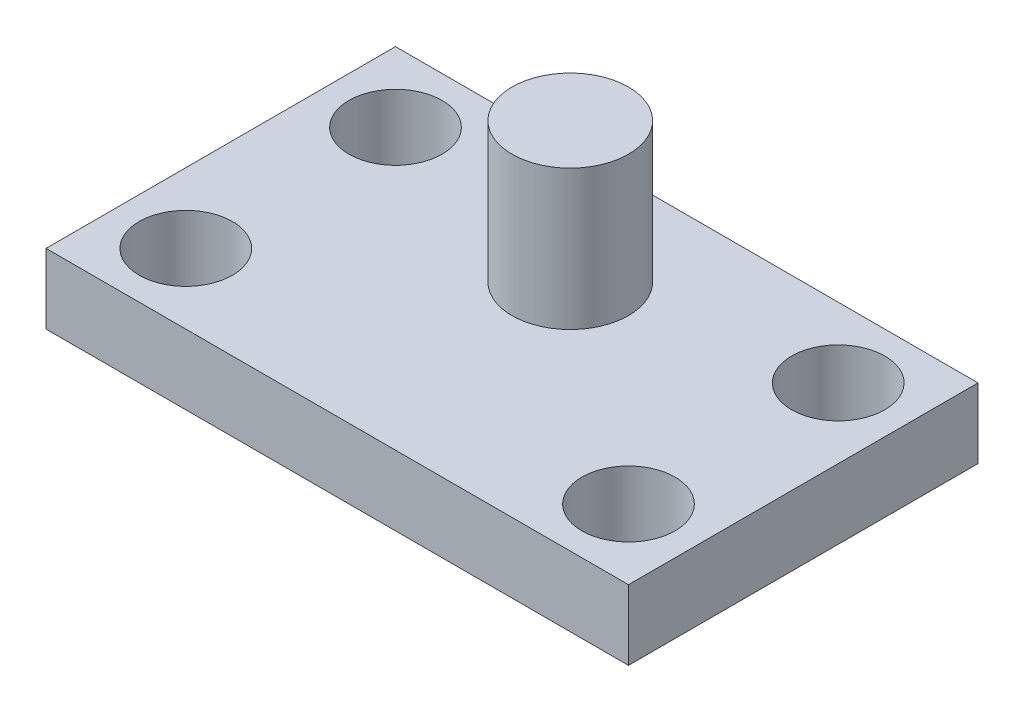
ISO-10303-21;
HEADER;
FILE_DESCRIPTION(('STEP AP214'),'2;1');
FILE_NAME('part.step','',(''),(''),'','','');
FILE_SCHEMA(('AUTOMOTIVE_DESIGN { 1 0 10303 214 1 1 1 1 }'));
ENDSEC;
DATA;
#1=APPLICATION_CONTEXT('core data for automotive mechanical design processes');
#2=APPLICATION_PROTOCOL_DEFINITION('international standard','automotive_design',2000,#1);
#3=PRODUCT_CONTEXT('',#1,'mechanical');
#4=PRODUCT('Part','Part','',(#3));
#5=PRODUCT_RELATED_PRODUCT_CATEGORY('part','',(#4));
#6=PRODUCT_DEFINITION_FORMATION('','',#4);
#7=PRODUCT_DEFINITION_CONTEXT('part definition',#1,'design');
#8=PRODUCT_DEFINITION('design','',#6,#7);
#9=PRODUCT_DEFINITION_SHAPE('','',#8);
#10=(LENGTH_UNIT() NAMED_UNIT(*) SI_UNIT(.MILLI.,.METRE.));
#11=(NAMED_UNIT(*) PLANE_ANGLE_UNIT() SI_UNIT($,.RADIAN.));
#12=(NAMED_UNIT(*) SI_UNIT($,.STERADIAN.) SOLID_ANGLE_UNIT());
#13=UNCERTAINTY_MEASURE_WITH_UNIT(LENGTH_MEASURE(1.E-05),#10,'distance_accuracy_value','');
#14=(GEOMETRIC_REPRESENTATION_CONTEXT(3) GLOBAL_UNCERTAINTY_ASSIGNED_CONTEXT((#13)) GLOBAL_UNIT_ASSIGNED_CONTEXT((#10,
#11,#12)) REPRESENTATION_CONTEXT('',''));
#15=CARTESIAN_POINT('',(0.,0.,0.));
#16=DIRECTION('',(0.,0.,1.));
#17=DIRECTION('',(1.,0.,0.));
#18=AXIS2_PLACEMENT_3D('',#15,#16,#17);
#19=CARTESIAN_POINT('',(0.,30.,0.));
#20=DIRECTION('',(0.,-1.,0.));
#21=DIRECTION('',(0.,0.,-1.));
#22=AXIS2_PLACEMENT_3D('',#19,#20,#21);
#23=PLANE('',#22);
#24=CARTESIAN_POINT('',(125.,30.,-100.));
#25=DIRECTION('',(0.,-1.,0.));
#26=DIRECTION('',(0.,0.,-1.));
#27=AXIS2_PLACEMENT_3D('',#24,#25,#26);
#28=CIRCLE('',#27,25.);
#29=CARTESIAN_POINT('',(125.,30.,-125.));
#30=VERTEX_POINT('',#29);
#31=EDGE_CURVE('E139',#30,#30,#28,.T.);
#32=ORIENTED_EDGE('',*,*,#31,.T.);
#33=EDGE_LOOP('',(#32));
#34=FACE_BOUND('',#33,.T.);
#35=DIRECTION('',(0.,0.,1.));
#36=VECTOR('',#35,1.);
#37=CARTESIAN_POINT('',(0.,30.,0.));
#38=LINE('',#37,#36);
#39=CARTESIAN_POINT('',(0.,30.,-150.));
#40=VERTEX_POINT('',#39);
#41=CARTESIAN_POINT('',(0.,30.,0.));
#42=VERTEX_POINT('',#41);
#43=EDGE_CURVE('E91',#40,#42,#38,.T.);
#44=ORIENTED_EDGE('',*,*,#43,.T.);
#45=DIRECTION('',(1.,0.,0.));
#46=VECTOR('',#45,1.);
#47=CARTESIAN_POINT('',(0.,30.,0.));
#48=LINE('',#47,#46);
#49=CARTESIAN_POINT('',(250.,30.,0.));
#50=VERTEX_POINT('',#49);
#51=EDGE_CURVE('E86',#42,#50,#48,.T.);
#52=ORIENTED_EDGE('',*,*,#51,.T.);
#53=DIRECTION('',(0.,0.,-1.));
#54=VECTOR('',#53,1.);
#55=CARTESIAN_POINT('',(250.,30.,0.));
#56=LINE('',#55,#54);
#57=CARTESIAN_POINT('',(250.,30.,-150.));
#58=VERTEX_POINT('',#57);
#59=EDGE_CURVE('E89',#50,#58,#56,.T.);
#60=ORIENTED_EDGE('',*,*,#59,.T.);
#61=DIRECTION('',(-1.,0.,0.));
#62=VECTOR('',#61,1.);
#63=CARTESIAN_POINT('',(0.,30.,-150.));
#64=LINE('',#63,#62);
#65=EDGE_CURVE('E56',#58,#40,#64,.T.);
#66=ORIENTED_EDGE('',*,*,#65,.T.);
#67=EDGE_LOOP('',(#44,#52,#60,#66));
#68=FACE_BOUND('',#67,.T.);
#69=CARTESIAN_POINT('',(30.,30.,-120.));
#70=DIRECTION('',(0.,1.,0.));
#71=DIRECTION('',(0.,0.,1.));
#72=AXIS2_PLACEMENT_3D('',#69,#70,#71);
#73=CIRCLE('',#72,20.);
#74=CARTESIAN_POINT('',(30.,30.,-100.));
#75=VERTEX_POINT('',#74);
#76=EDGE_CURVE('E106',#75,#75,#73,.T.);
#77=ORIENTED_EDGE('',*,*,#76,.F.);
#78=EDGE_LOOP('',(#77));
#79=FACE_BOUND('',#78,.T.);
#80=CARTESIAN_POINT('',(30.,30.,-30.));
#81=DIRECTION('',(0.,1.,0.));
#82=DIRECTION('',(0.,0.,1.));
#83=AXIS2_PLACEMENT_3D('',#80,#81,#82);
#84=CIRCLE('',#83,20.);
#85=CARTESIAN_POINT('',(30.,30.,-9.99999999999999));
#86=VERTEX_POINT('',#85);
#87=EDGE_CURVE('E121',#86,#86,#84,.T.);
#88=ORIENTED_EDGE('',*,*,#87,.F.);
#89=EDGE_LOOP('',(#88));
#90=FACE_BOUND('',#89,.T.);
#91=CARTESIAN_POINT('',(220.,30.,-30.));
#92=DIRECTION('',(0.,1.,0.));
#93=DIRECTION('',(0.,0.,1.));
#94=AXIS2_PLACEMENT_3D('',#91,#92,#93);
#95=CIRCLE('',#94,20.);
#96=CARTESIAN_POINT('',(220.,30.,-10.));
#97=VERTEX_POINT('',#96);
#98=EDGE_CURVE('E127',#97,#97,#95,.T.);
#99=ORIENTED_EDGE('',*,*,#98,.F.);
#100=EDGE_LOOP('',(#99));
#101=FACE_BOUND('',#100,.T.);
#102=CARTESIAN_POINT('',(220.,30.,-120.));
#103=DIRECTION('',(0.,1.,0.));
#104=DIRECTION('',(0.,0.,1.));
#105=AXIS2_PLACEMENT_3D('',#102,#103,#104);
#106=CIRCLE('',#105,20.);
#107=CARTESIAN_POINT('',(220.,30.,-100.));
#108=VERTEX_POINT('',#107);
#109=EDGE_CURVE('E133',#108,#108,#106,.T.);
#110=ORIENTED_EDGE('',*,*,#109,.F.);
#111=EDGE_LOOP('',(#110));
#112=FACE_BOUND('',#111,.T.);
#113=ADVANCED_FACE('F39',(#34,#68,#79,#90,#101,#112),#23,.F.);
#114=CARTESIAN_POINT('',(0.,0.,0.));
#115=DIRECTION('',(0.,-1.,0.));
#116=DIRECTION('',(0.,0.,-1.));
#117=AXIS2_PLACEMENT_3D('',#114,#115,#116);
#118=PLANE('',#117);
#119=CARTESIAN_POINT('',(220.,0.,-30.));
#120=DIRECTION('',(0.,1.,0.));
#121=DIRECTION('',(0.,0.,1.));
#122=AXIS2_PLACEMENT_3D('',#119,#120,#121);
#123=CIRCLE('',#122,20.);
#124=CARTESIAN_POINT('',(220.,0.,-10.));
#125=VERTEX_POINT('',#124);
#126=EDGE_CURVE('E130',#125,#125,#123,.T.);
#127=ORIENTED_EDGE('',*,*,#126,.T.);
#128=EDGE_LOOP('',(#127));
#129=FACE_BOUND('',#128,.T.);
#130=CARTESIAN_POINT('',(30.,0.,-120.));
#131=DIRECTION('',(0.,1.,0.));
#132=DIRECTION('',(0.,0.,1.));
#133=AXIS2_PLACEMENT_3D('',#130,#131,#132);
#134=CIRCLE('',#133,20.);
#135=CARTESIAN_POINT('',(30.,0.,-100.));
#136=VERTEX_POINT('',#135);
#137=EDGE_CURVE('E118',#136,#136,#134,.T.);
#138=ORIENTED_EDGE('',*,*,#137,.T.);
#139=EDGE_LOOP('',(#138));
#140=FACE_BOUND('',#139,.T.);
#141=DIRECTION('',(0.,0.,1.));
#142=VECTOR('',#141,1.);
#143=CARTESIAN_POINT('',(0.,0.,0.));
#144=LINE('',#143,#142);
#145=CARTESIAN_POINT('',(0.,0.,-150.));
#146=VERTEX_POINT('',#145);
#147=CARTESIAN_POINT('',(0.,0.,0.));
#148=VERTEX_POINT('',#147);
#149=EDGE_CURVE('E103',#146,#148,#144,.T.);
#150=ORIENTED_EDGE('',*,*,#149,.F.);
#151=DIRECTION('',(-1.,0.,0.));
#152=VECTOR('',#151,1.);
#153=CARTESIAN_POINT('',(0.,0.,-150.));
#154=LINE('',#153,#152);
#155=CARTESIAN_POINT('',(250.,0.,-150.));
#156=VERTEX_POINT('',#155);
#157=EDGE_CURVE('E79',#156,#146,#154,.T.);
#158=ORIENTED_EDGE('',*,*,#157,.F.);
#159=DIRECTION('',(0.,0.,-1.));
#160=VECTOR('',#159,1.);
#161=CARTESIAN_POINT('',(250.,0.,0.));
#162=LINE('',#161,#160);
#163=CARTESIAN_POINT('',(250.,0.,0.));
#164=VERTEX_POINT('',#163);
#165=EDGE_CURVE('E73',#164,#156,#162,.T.);
#166=ORIENTED_EDGE('',*,*,#165,.F.);
#167=DIRECTION('',(1.,0.,0.));
#168=VECTOR('',#167,1.);
#169=CARTESIAN_POINT('',(0.,0.,0.));
#170=LINE('',#169,#168);
#171=EDGE_CURVE('E95',#148,#164,#170,.T.);
#172=ORIENTED_EDGE('',*,*,#171,.F.);
#173=EDGE_LOOP('',(#150,#158,#166,#172));
#174=FACE_BOUND('',#173,.T.);
#175=CARTESIAN_POINT('',(30.,0.,-30.));
#176=DIRECTION('',(0.,1.,0.));
#177=DIRECTION('',(0.,0.,1.));
#178=AXIS2_PLACEMENT_3D('',#175,#176,#177);
#179=CIRCLE('',#178,20.);
#180=CARTESIAN_POINT('',(30.,0.,-9.99999999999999));
#181=VERTEX_POINT('',#180);
#182=EDGE_CURVE('E124',#181,#181,#179,.T.);
#183=ORIENTED_EDGE('',*,*,#182,.T.);
#184=EDGE_LOOP('',(#183));
#185=FACE_BOUND('',#184,.T.);
#186=CARTESIAN_POINT('',(220.,0.,-120.));
#187=DIRECTION('',(0.,1.,0.));
#188=DIRECTION('',(0.,0.,1.));
#189=AXIS2_PLACEMENT_3D('',#186,#187,#188);
#190=CIRCLE('',#189,20.);
#191=CARTESIAN_POINT('',(220.,0.,-100.));
#192=VERTEX_POINT('',#191);
#193=EDGE_CURVE('E136',#192,#192,#190,.T.);
#194=ORIENTED_EDGE('',*,*,#193,.T.);
#195=EDGE_LOOP('',(#194));
#196=FACE_BOUND('',#195,.T.);
#197=ADVANCED_FACE('F114',(#129,#140,#174,#185,#196),#118,.T.);
#198=CARTESIAN_POINT('',(0.,30.,0.));
#199=DIRECTION('',(1.,0.,0.));
#200=DIRECTION('',(0.,0.,-1.));
#201=AXIS2_PLACEMENT_3D('',#198,#199,#200);
#202=PLANE('',#201);
#203=ORIENTED_EDGE('',*,*,#149,.T.);
#204=DIRECTION('',(0.,-1.,0.));
#205=VECTOR('',#204,1.);
#206=CARTESIAN_POINT('',(0.,30.,0.));
#207=LINE('',#206,#205);
#208=EDGE_CURVE('E11',#42,#148,#207,.T.);
#209=ORIENTED_EDGE('',*,*,#208,.F.);
#210=ORIENTED_EDGE('',*,*,#43,.F.);
#211=DIRECTION('',(0.,-1.,0.));
#212=VECTOR('',#211,1.);
#213=CARTESIAN_POINT('',(0.,30.,-150.));
#214=LINE('',#213,#212);
#215=EDGE_CURVE('E99',#40,#146,#214,.T.);
#216=ORIENTED_EDGE('',*,*,#215,.T.);
#217=EDGE_LOOP('',(#203,#209,#210,#216));
#218=FACE_BOUND('',#217,.T.);
#219=ADVANCED_FACE('F41',(#218),#202,.F.);
#220=CARTESIAN_POINT('',(0.,30.,0.));
#221=DIRECTION('',(0.,0.,-1.));
#222=DIRECTION('',(-1.,0.,0.));
#223=AXIS2_PLACEMENT_3D('',#220,#221,#222);
#224=PLANE('',#223);
#225=ORIENTED_EDGE('',*,*,#171,.T.);
#226=DIRECTION('',(0.,-1.,0.));
#227=VECTOR('',#226,1.);
#228=CARTESIAN_POINT('',(250.,30.,0.));
#229=LINE('',#228,#227);
#230=EDGE_CURVE('E48',#50,#164,#229,.T.);
#231=ORIENTED_EDGE('',*,*,#230,.F.);
#232=ORIENTED_EDGE('',*,*,#51,.F.);
#233=ORIENTED_EDGE('',*,*,#208,.T.);
#234=EDGE_LOOP('',(#225,#231,#232,#233));
#235=FACE_BOUND('',#234,.T.);
#236=ADVANCED_FACE('F94',(#235),#224,.F.);
#237=CARTESIAN_POINT('',(250.,30.,0.));
#238=DIRECTION('',(-1.,0.,0.));
#239=DIRECTION('',(0.,0.,1.));
#240=AXIS2_PLACEMENT_3D('',#237,#238,#239);
#241=PLANE('',#240);
#242=ORIENTED_EDGE('',*,*,#165,.T.);
#243=DIRECTION('',(0.,-1.,0.));
#244=VECTOR('',#243,1.);
#245=CARTESIAN_POINT('',(250.,30.,-150.));
#246=LINE('',#245,#244);
#247=EDGE_CURVE('E96',#58,#156,#246,.T.);
#248=ORIENTED_EDGE('',*,*,#247,.F.);
#249=ORIENTED_EDGE('',*,*,#59,.F.);
#250=ORIENTED_EDGE('',*,*,#230,.T.);
#251=EDGE_LOOP('',(#242,#248,#249,#250));
#252=FACE_BOUND('',#251,.T.);
#253=ADVANCED_FACE('F97',(#252),#241,.F.);
#254=CARTESIAN_POINT('',(0.,30.,-150.));
#255=DIRECTION('',(0.,0.,1.));
#256=DIRECTION('',(1.,0.,0.));
#257=AXIS2_PLACEMENT_3D('',#254,#255,#256);
#258=PLANE('',#257);
#259=ORIENTED_EDGE('',*,*,#157,.T.);
#260=ORIENTED_EDGE('',*,*,#215,.F.);
#261=ORIENTED_EDGE('',*,*,#65,.F.);
#262=ORIENTED_EDGE('',*,*,#247,.T.);
#263=EDGE_LOOP('',(#259,#260,#261,#262));
#264=FACE_BOUND('',#263,.T.);
#265=ADVANCED_FACE('F111',(#264),#258,.F.);
#266=CARTESIAN_POINT('',(30.,30.,-120.));
#267=DIRECTION('',(0.,-1.,0.));
#268=DIRECTION('',(0.,0.,-1.));
#269=AXIS2_PLACEMENT_3D('',#266,#267,#268);
#270=CYLINDRICAL_SURFACE('',#269,20.);
#271=ORIENTED_EDGE('',*,*,#76,.T.);
#272=EDGE_LOOP('',(#271));
#273=FACE_BOUND('',#272,.T.);
#274=ORIENTED_EDGE('',*,*,#137,.F.);
#275=EDGE_LOOP('',(#274));
#276=FACE_BOUND('',#275,.T.);
#277=ADVANCED_FACE('F169',(#273,#276),#270,.F.);
#278=CARTESIAN_POINT('',(30.,30.,-30.));
#279=DIRECTION('',(0.,-1.,0.));
#280=DIRECTION('',(0.,0.,-1.));
#281=AXIS2_PLACEMENT_3D('',#278,#279,#280);
#282=CYLINDRICAL_SURFACE('',#281,20.);
#283=ORIENTED_EDGE('',*,*,#87,.T.);
#284=EDGE_LOOP('',(#283));
#285=FACE_BOUND('',#284,.T.);
#286=ORIENTED_EDGE('',*,*,#182,.F.);
#287=EDGE_LOOP('',(#286));
#288=FACE_BOUND('',#287,.T.);
#289=ADVANCED_FACE('F211',(#285,#288),#282,.F.);
#290=CARTESIAN_POINT('',(220.,30.,-30.));
#291=DIRECTION('',(0.,-1.,0.));
#292=DIRECTION('',(0.,0.,-1.));
#293=AXIS2_PLACEMENT_3D('',#290,#291,#292);
#294=CYLINDRICAL_SURFACE('',#293,20.);
#295=ORIENTED_EDGE('',*,*,#98,.T.);
#296=EDGE_LOOP('',(#295));
#297=FACE_BOUND('',#296,.T.);
#298=ORIENTED_EDGE('',*,*,#126,.F.);
#299=EDGE_LOOP('',(#298));
#300=FACE_BOUND('',#299,.T.);
#301=ADVANCED_FACE('F220',(#297,#300),#294,.F.);
#302=CARTESIAN_POINT('',(220.,30.,-120.));
#303=DIRECTION('',(0.,-1.,0.));
#304=DIRECTION('',(0.,0.,-1.));
#305=AXIS2_PLACEMENT_3D('',#302,#303,#304);
#306=CYLINDRICAL_SURFACE('',#305,20.);
#307=ORIENTED_EDGE('',*,*,#109,.T.);
#308=EDGE_LOOP('',(#307));
#309=FACE_BOUND('',#308,.T.);
#310=ORIENTED_EDGE('',*,*,#193,.F.);
#311=EDGE_LOOP('',(#310));
#312=FACE_BOUND('',#311,.T.);
#313=ADVANCED_FACE('F157',(#309,#312),#306,.F.);
#314=CARTESIAN_POINT('',(125.,90.,-100.));
#315=DIRECTION('',(0.,-1.,0.));
#316=DIRECTION('',(0.,0.,-1.));
#317=AXIS2_PLACEMENT_3D('',#314,#315,#316);
#318=CYLINDRICAL_SURFACE('',#317,25.);
#319=CARTESIAN_POINT('',(125.,90.,-100.));
#320=DIRECTION('',(0.,-1.,0.));
#321=DIRECTION('',(0.,0.,-1.));
#322=AXIS2_PLACEMENT_3D('',#319,#320,#321);
#323=CIRCLE('',#322,25.);
#324=CARTESIAN_POINT('',(125.,90.,-125.));
#325=VERTEX_POINT('',#324);
#326=EDGE_CURVE('E144',#325,#325,#323,.T.);
#327=CARTESIAN_POINT('',(125.,90.,-125.));
#328=CARTESIAN_POINT('',(125.,89.375,-125.));
#329=CARTESIAN_POINT('',(125.,88.75,-125.));
#330=CARTESIAN_POINT('',(125.,87.5,-125.));
#331=CARTESIAN_POINT('',(125.,86.875,-125.));
#332=CARTESIAN_POINT('',(125.,85.625,-125.));
#333=CARTESIAN_POINT('',(125.,85.,-125.));
#334=CARTESIAN_POINT('',(125.,83.75,-125.));
#335=CARTESIAN_POINT('',(125.,83.125,-125.));
#336=CARTESIAN_POINT('',(125.,81.875,-125.));
#337=CARTESIAN_POINT('',(125.,81.25,-125.));
#338=CARTESIAN_POINT('',(125.,80.,-125.));
#339=CARTESIAN_POINT('',(125.,79.375,-125.));
#340=CARTESIAN_POINT('',(125.,78.125,-125.));
#341=CARTESIAN_POINT('',(125.,77.5,-125.));
#342=CARTESIAN_POINT('',(125.,76.25,-125.));
#343=CARTESIAN_POINT('',(125.,75.625,-125.));
#344=CARTESIAN_POINT('',(125.,74.375,-125.));
#345=CARTESIAN_POINT('',(125.,73.75,-125.));
#346=CARTESIAN_POINT('',(125.,72.5,-125.));
#347=CARTESIAN_POINT('',(125.,71.875,-125.));
#348=CARTESIAN_POINT('',(125.,70.625,-125.));
#349=CARTESIAN_POINT('',(125.,70.,-125.));
#350=CARTESIAN_POINT('',(125.,68.75,-125.));
#351=CARTESIAN_POINT('',(125.,68.125,-125.));
#352=CARTESIAN_POINT('',(125.,66.875,-125.));
#353=CARTESIAN_POINT('',(125.,66.25,-125.));
#354=CARTESIAN_POINT('',(125.,65.,-125.));
#355=CARTESIAN_POINT('',(125.,64.375,-125.));
#356=CARTESIAN_POINT('',(125.,63.125,-125.));
#357=CARTESIAN_POINT('',(125.,62.5,-125.));
#358=CARTESIAN_POINT('',(125.,61.25,-125.));
#359=CARTESIAN_POINT('',(125.,60.625,-125.));
#360=CARTESIAN_POINT('',(125.,59.375,-125.));
#361=CARTESIAN_POINT('',(125.,58.75,-125.));
#362=CARTESIAN_POINT('',(125.,57.5,-125.));
#363=CARTESIAN_POINT('',(125.,56.875,-125.));
#364=CARTESIAN_POINT('',(125.,55.625,-125.));
#365=CARTESIAN_POINT('',(125.,55.,-125.));
#366=CARTESIAN_POINT('',(125.,53.75,-125.));
#367=CARTESIAN_POINT('',(125.,53.125,-125.));
#368=CARTESIAN_POINT('',(125.,51.875,-125.));
#369=CARTESIAN_POINT('',(125.,51.25,-125.));
#370=CARTESIAN_POINT('',(125.,50.,-125.));
#371=CARTESIAN_POINT('',(125.,49.375,-125.));
#372=CARTESIAN_POINT('',(125.,48.125,-125.));
#373=CARTESIAN_POINT('',(125.,47.5,-125.));
#374=CARTESIAN_POINT('',(125.,46.25,-125.));
#375=CARTESIAN_POINT('',(125.,45.625,-125.));
#376=CARTESIAN_POINT('',(125.,44.375,-125.));
#377=CARTESIAN_POINT('',(125.,43.75,-125.));
#378=CARTESIAN_POINT('',(125.,42.5,-125.));
#379=CARTESIAN_POINT('',(125.,41.875,-125.));
#380=CARTESIAN_POINT('',(125.,40.625,-125.));
#381=CARTESIAN_POINT('',(125.,40.,-125.));
#382=CARTESIAN_POINT('',(125.,38.75,-125.));
#383=CARTESIAN_POINT('',(125.,38.125,-125.));
#384=CARTESIAN_POINT('',(125.,36.875,-125.));
#385=CARTESIAN_POINT('',(125.,36.25,-125.));
#386=CARTESIAN_POINT('',(125.,35.,-125.));
#387=CARTESIAN_POINT('',(125.,34.375,-125.));
#388=CARTESIAN_POINT('',(125.,33.125,-125.));
#389=CARTESIAN_POINT('',(125.,32.5,-125.));
#390=CARTESIAN_POINT('',(125.,31.25,-125.));
#391=CARTESIAN_POINT('',(125.,30.625,-125.));
#392=CARTESIAN_POINT('',(125.,30.,-125.));
#393=B_SPLINE_CURVE_WITH_KNOTS('',3,(#327,#328,#329,#330,#331,#332,#333,#334,#335,#336,#337,
#338,#339,#340,#341,#342,#343,#344,#345,#346,#347,#348,#349,#350,#351,#352,#353,#354,#355,#356,
#357,#358,#359,#360,#361,#362,#363,#364,#365,#366,#367,#368,#369,#370,#371,#372,#373,#374,#375,
#376,#377,#378,#379,#380,#381,#382,#383,#384,#385,#386,#387,#388,#389,#390,#391,#392),
.UNSPECIFIED.,.F.,.F.,(4,2,2,2,2,2,2,2,2,2,2,2,2,2,2,2,2,2,2,2,2,2,2,2,2,2,2,2,2,2,2,2,4),(0.,
1.875,3.75,5.62500000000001,7.50000000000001,9.37500000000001,11.25,13.125,15.,16.875,18.75,
20.625,22.5,24.375,26.25,28.125,30.,31.875,33.75,35.625,37.5,39.375,41.25,43.125,45.,46.875,
48.75,50.625,52.5,54.375,56.25,58.125,60.),.UNSPECIFIED.);
#394=EDGE_CURVE('BSEAM148',#325,#30,#393,.T.);
#395=ORIENTED_EDGE('',*,*,#326,.T.);
#396=ORIENTED_EDGE('',*,*,#31,.F.);
#397=ORIENTED_EDGE('',*,*,#394,.T.);
#398=ORIENTED_EDGE('',*,*,#394,.F.);
#399=EDGE_LOOP('',(#395,#397,#396,#398));
#400=FACE_BOUND('',#399,.T.);
#401=ADVANCED_FACE('F148',(#400),#318,.T.);
#402=CARTESIAN_POINT('',(125.,90.,-100.));
#403=DIRECTION('',(0.,-1.,0.));
#404=DIRECTION('',(0.,0.,-1.));
#405=AXIS2_PLACEMENT_3D('',#402,#403,#404);
#406=PLANE('',#405);
#407=ORIENTED_EDGE('',*,*,#326,.F.);
#408=EDGE_LOOP('',(#407));
#409=FACE_BOUND('',#408,.T.);
#410=ADVANCED_FACE('F151',(#409),#406,.F.);
#411=CLOSED_SHELL('',(#113,#197,#219,#236,#253,#265,#277,#289,#301,#313,#401,#410));
#412=MANIFOLD_SOLID_BREP('B2',#411);
#413=ADVANCED_BREP_SHAPE_REPRESENTATION('',(#18,#412),#14);
#414=SHAPE_DEFINITION_REPRESENTATION(#9,#413);
ENDSEC;
END-ISO-10303-21;
